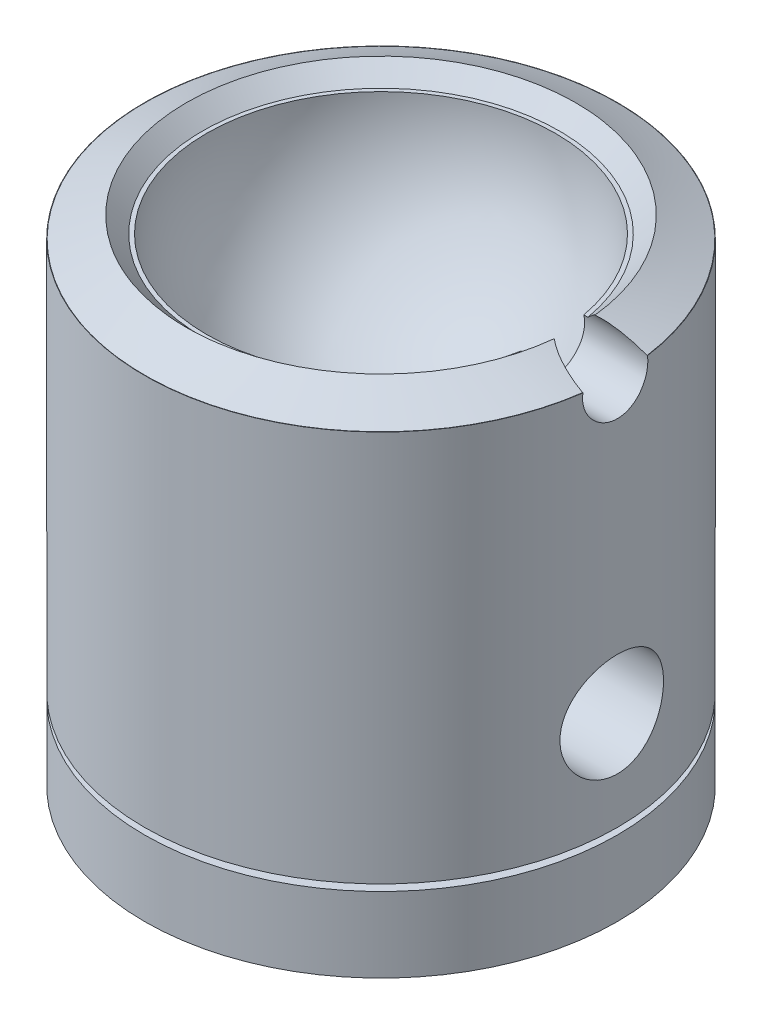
ISO-10303-21;
HEADER;
FILE_DESCRIPTION(('STEP AP214'),'2;1');
FILE_NAME('part.step','',(''),(''),'','','');
FILE_SCHEMA(('AUTOMOTIVE_DESIGN { 1 0 10303 214 1 1 1 1 }'));
ENDSEC;
DATA;
#1=APPLICATION_CONTEXT('core data for automotive mechanical design processes');
#2=APPLICATION_PROTOCOL_DEFINITION('international standard','automotive_design',2000,#1);
#3=PRODUCT_CONTEXT('',#1,'mechanical');
#4=PRODUCT('Part','Part','',(#3));
#5=PRODUCT_RELATED_PRODUCT_CATEGORY('part','',(#4));
#6=PRODUCT_DEFINITION_FORMATION('','',#4);
#7=PRODUCT_DEFINITION_CONTEXT('part definition',#1,'design');
#8=PRODUCT_DEFINITION('design','',#6,#7);
#9=PRODUCT_DEFINITION_SHAPE('','',#8);
#10=(LENGTH_UNIT() NAMED_UNIT(*) SI_UNIT(.MILLI.,.METRE.));
#11=(NAMED_UNIT(*) PLANE_ANGLE_UNIT() SI_UNIT($,.RADIAN.));
#12=(NAMED_UNIT(*) SI_UNIT($,.STERADIAN.) SOLID_ANGLE_UNIT());
#13=UNCERTAINTY_MEASURE_WITH_UNIT(LENGTH_MEASURE(1.E-05),#10,'distance_accuracy_value','');
#14=(GEOMETRIC_REPRESENTATION_CONTEXT(3) GLOBAL_UNCERTAINTY_ASSIGNED_CONTEXT((#13)) GLOBAL_UNIT_ASSIGNED_CONTEXT((#10,
#11,#12)) REPRESENTATION_CONTEXT('',''));
#15=CARTESIAN_POINT('',(0.,0.,0.));
#16=DIRECTION('',(0.,0.,1.));
#17=DIRECTION('',(1.,0.,0.));
#18=AXIS2_PLACEMENT_3D('',#15,#16,#17);
#19=CARTESIAN_POINT('',(0.,29.,0.));
#20=DIRECTION('',(0.,-1.,0.));
#21=DIRECTION('',(0.,0.,-1.));
#22=AXIS2_PLACEMENT_3D('',#19,#20,#21);
#23=CYLINDRICAL_SURFACE('',#22,14.5);
#24=CARTESIAN_POINT('',(-14.100984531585,20.063256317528,3.3782));
#25=CARTESIAN_POINT('',(-14.1009882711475,19.8762854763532,3.37819402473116));
#26=CARTESIAN_POINT('',(-14.1047437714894,19.6892454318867,3.36262495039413));
#27=CARTESIAN_POINT('',(-14.119327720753,19.320507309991,3.3008417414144));
#28=CARTESIAN_POINT('',(-14.1301608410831,19.1388128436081,3.25460736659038));
#29=CARTESIAN_POINT('',(-14.1576080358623,18.7861528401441,3.1330472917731));
#30=CARTESIAN_POINT('',(-14.1742152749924,18.6151748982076,3.05775597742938));
#31=CARTESIAN_POINT('',(-14.2113311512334,18.2882667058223,2.88032065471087));
#32=CARTESIAN_POINT('',(-14.2318398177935,18.1323365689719,2.77817644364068));
#33=CARTESIAN_POINT('',(-14.274886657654,17.8369651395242,2.54784912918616));
#34=CARTESIAN_POINT('',(-14.2974536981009,17.6978540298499,2.41924791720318));
#35=CARTESIAN_POINT('',(-14.3418228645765,17.4429687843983,2.14055887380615));
#36=CARTESIAN_POINT('',(-14.3636249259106,17.3271966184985,1.99046923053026));
#37=CARTESIAN_POINT('',(-14.4043242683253,17.1209496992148,1.67082860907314));
#38=CARTESIAN_POINT('',(-14.4231835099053,17.0307955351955,1.50106551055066));
#39=CARTESIAN_POINT('',(-14.4555447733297,16.8804224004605,1.1482839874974));
#40=CARTESIAN_POINT('',(-14.4690474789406,16.8201996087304,0.965267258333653));
#41=CARTESIAN_POINT('',(-14.4889702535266,16.7324456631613,0.594611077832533));
#42=CARTESIAN_POINT('',(-14.4955114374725,16.704354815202,0.407110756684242));
#43=CARTESIAN_POINT('',(-14.5011948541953,16.6799091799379,0.0299524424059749));
#44=CARTESIAN_POINT('',(-14.5003380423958,16.6835502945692,-0.15970526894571));
#45=CARTESIAN_POINT('',(-14.4914135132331,16.7220546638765,-0.53192604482));
#46=CARTESIAN_POINT('',(-14.4834852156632,16.7563142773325,-0.71455539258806));
#47=CARTESIAN_POINT('',(-14.4614688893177,16.8541175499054,-1.07139865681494));
#48=CARTESIAN_POINT('',(-14.4473805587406,16.9176626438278,-1.24561216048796));
#49=CARTESIAN_POINT('',(-14.4144077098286,17.0727467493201,-1.5823164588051));
#50=CARTESIAN_POINT('',(-14.395485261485,17.1645083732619,-1.74470085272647));
#51=CARTESIAN_POINT('',(-14.3549094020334,17.3732535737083,-2.05198279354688));
#52=CARTESIAN_POINT('',(-14.333255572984,17.4902410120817,-2.19687765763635));
#53=CARTESIAN_POINT('',(-14.2889865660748,17.7493816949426,-2.46866268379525));
#54=CARTESIAN_POINT('',(-14.2663607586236,17.8920630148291,-2.59504809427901));
#55=CARTESIAN_POINT('',(-14.2231710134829,18.1968313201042,-2.82220023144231));
#56=CARTESIAN_POINT('',(-14.2026071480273,18.358918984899,-2.92296606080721));
#57=CARTESIAN_POINT('',(-14.1658367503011,18.6987909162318,-3.09628565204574));
#58=CARTESIAN_POINT('',(-14.1496467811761,18.87663155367,-3.16873262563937));
#59=CARTESIAN_POINT('',(-14.1236782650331,19.2424324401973,-3.2825533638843));
#60=CARTESIAN_POINT('',(-14.1138985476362,19.4303908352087,-3.32393280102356));
#61=CARTESIAN_POINT('',(-14.1020996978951,19.8064492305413,-3.37363713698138));
#62=CARTESIAN_POINT('',(-14.0999068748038,19.9944460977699,-3.38270198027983));
#63=CARTESIAN_POINT('',(-14.1030596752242,20.3692651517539,-3.36953304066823));
#64=CARTESIAN_POINT('',(-14.1084047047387,20.5560874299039,-3.34730172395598));
#65=CARTESIAN_POINT('',(-14.1258658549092,20.920603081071,-3.27281663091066));
#66=CARTESIAN_POINT('',(-14.137887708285,21.0983867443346,-3.22098054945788));
#67=CARTESIAN_POINT('',(-14.1672609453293,21.4427441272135,-3.08921435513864));
#68=CARTESIAN_POINT('',(-14.1846128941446,21.6093166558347,-3.00928126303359));
#69=CARTESIAN_POINT('',(-14.2230657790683,21.9296961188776,-2.82199594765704));
#70=CARTESIAN_POINT('',(-14.2442263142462,22.0832327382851,-2.71419380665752));
#71=CARTESIAN_POINT('',(-14.2877598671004,22.3703084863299,-2.47481038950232));
#72=CARTESIAN_POINT('',(-14.3101330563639,22.503844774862,-2.34322574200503));
#73=CARTESIAN_POINT('',(-14.3541506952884,22.7500562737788,-2.05664296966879));
#74=CARTESIAN_POINT('',(-14.3757692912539,22.8622237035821,-1.90120392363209));
#75=CARTESIAN_POINT('',(-14.415341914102,23.05885754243,-1.57326230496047));
#76=CARTESIAN_POINT('',(-14.4332961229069,23.1433253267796,-1.40076058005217));
#77=CARTESIAN_POINT('',(-14.4634092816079,23.281482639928,-1.0447288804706));
#78=CARTESIAN_POINT('',(-14.4756073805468,23.3353806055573,-0.861283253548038));
#79=CARTESIAN_POINT('',(-14.4930041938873,23.4115094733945,-0.487621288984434));
#80=CARTESIAN_POINT('',(-14.4982040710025,23.4337456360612,-0.297406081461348));
#81=CARTESIAN_POINT('',(-14.5009783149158,23.4456567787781,0.0795978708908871));
#82=CARTESIAN_POINT('',(-14.4987292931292,23.4360858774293,0.266361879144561));
#83=CARTESIAN_POINT('',(-14.4872426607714,23.3863591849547,0.635541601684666));
#84=CARTESIAN_POINT('',(-14.4780052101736,23.3462040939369,0.817957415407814));
#85=CARTESIAN_POINT('',(-14.4535991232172,23.2368300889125,1.17258798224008));
#86=CARTESIAN_POINT('',(-14.4384550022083,23.167731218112,1.344841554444));
#87=CARTESIAN_POINT('',(-14.4038424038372,23.0025435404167,1.67540352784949));
#88=CARTESIAN_POINT('',(-14.3843734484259,22.9064517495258,1.83371038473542));
#89=CARTESIAN_POINT('',(-14.3427082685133,22.6876169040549,2.13551969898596));
#90=CARTESIAN_POINT('',(-14.3204629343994,22.564351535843,2.27863668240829));
#91=CARTESIAN_POINT('',(-14.2759965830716,22.2957050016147,2.54241124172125));
#92=CARTESIAN_POINT('',(-14.25377557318,22.1503184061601,2.66306328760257));
#93=CARTESIAN_POINT('',(-14.2114830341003,21.8388219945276,2.88031622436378));
#94=CARTESIAN_POINT('',(-14.1914505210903,21.6724238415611,2.97651180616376));
#95=CARTESIAN_POINT('',(-14.1563075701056,21.3253829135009,3.13941912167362));
#96=CARTESIAN_POINT('',(-14.1411932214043,21.1447515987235,3.20615429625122));
#97=CARTESIAN_POINT('',(-14.1202049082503,20.813995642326,3.29719221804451));
#98=CARTESIAN_POINT('',(-14.1130478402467,20.6655785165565,3.32750848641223));
#99=CARTESIAN_POINT('',(-14.1034362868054,20.3658746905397,3.36801416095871));
#100=CARTESIAN_POINT('',(-14.1009815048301,20.214588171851,3.37820483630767));
#101=CARTESIAN_POINT('',(-14.100984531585,20.063256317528,3.3782));
#102=B_SPLINE_CURVE_WITH_KNOTS('',3,(#24,#25,#26,#27,#28,#29,#30,#31,#32,#33,#34,#35,#36,#37,
#38,#39,#40,#41,#42,#43,#44,#45,#46,#47,#48,#49,#50,#51,#52,#53,#54,#55,#56,#57,#58,#59,#60,#61,
#62,#63,#64,#65,#66,#67,#68,#69,#70,#71,#72,#73,#74,#75,#76,#77,#78,#79,#80,#81,#82,#83,#84,#85,
#86,#87,#88,#89,#90,#91,#92,#93,#94,#95,#96,#97,#98,#99,#100,#101),.UNSPECIFIED.,.T.,.F.,(4,2,2,
2,2,2,2,2,2,2,2,2,2,2,2,2,2,2,2,2,2,2,2,2,2,2,2,2,2,2,2,2,2,2,2,2,2,2,4),(0.,0.560357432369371,
1.1210850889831,1.68115121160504,2.24122156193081,2.81093651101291,3.38069952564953,
3.95730678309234,4.53384041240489,5.10017091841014,5.66642828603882,6.22176234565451,
6.77712361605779,7.33698394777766,7.89693005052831,8.47007149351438,9.04323300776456,
9.6185354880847,10.1937329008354,10.7556716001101,11.3175660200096,11.8717218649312,
12.425936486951,12.9897275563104,13.5535986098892,14.1295407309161,14.7054542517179,
15.2773922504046,15.8492352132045,16.4076178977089,16.9659878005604,17.5220644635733,
18.0782026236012,18.6461430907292,19.214223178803,19.7911806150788,20.3676781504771,
20.8212530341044,21.2747993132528),.UNSPECIFIED.);
#103=CARTESIAN_POINT('',(-14.100984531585,20.063256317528,3.3782));
#104=VERTEX_POINT('',#103);
#105=EDGE_CURVE('E12',#104,#104,#102,.T.);
#106=ORIENTED_EDGE('',*,*,#105,.T.);
#107=EDGE_LOOP('',(#106));
#108=FACE_BOUND('',#107,.T.);
#109=CARTESIAN_POINT('',(14.1481226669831,11.0195593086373,-3.175));
#110=CARTESIAN_POINT('',(14.1481262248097,10.8435273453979,-3.1749939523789));
#111=CARTESIAN_POINT('',(14.1514437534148,10.667422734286,-3.1603105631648));
#112=CARTESIAN_POINT('',(14.1643309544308,10.3202219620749,-3.10202946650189));
#113=CARTESIAN_POINT('',(14.1739051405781,10.1491295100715,-3.05841088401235));
#114=CARTESIAN_POINT('',(14.1981705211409,9.81702568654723,-2.94369897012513));
#115=CARTESIAN_POINT('',(14.2128560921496,9.65600346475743,-2.87263582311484));
#116=CARTESIAN_POINT('',(14.245682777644,9.34816299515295,-2.70513841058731));
#117=CARTESIAN_POINT('',(14.2638238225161,9.20134446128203,-2.60870465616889));
#118=CARTESIAN_POINT('',(14.3018605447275,8.92359115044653,-2.39146318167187));
#119=CARTESIAN_POINT('',(14.3217787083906,8.79293184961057,-2.27030712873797));
#120=CARTESIAN_POINT('',(14.3609285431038,8.55361867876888,-2.00781216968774));
#121=CARTESIAN_POINT('',(14.3801601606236,8.44496652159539,-1.86647169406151));
#122=CARTESIAN_POINT('',(14.4160149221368,8.25166194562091,-1.56577281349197));
#123=CARTESIAN_POINT('',(14.4326084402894,8.16727452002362,-1.40624022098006));
#124=CARTESIAN_POINT('',(14.4610633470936,8.02660934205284,-1.07483427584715));
#125=CARTESIAN_POINT('',(14.4729252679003,7.97032842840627,-0.902962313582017));
#126=CARTESIAN_POINT('',(14.4904215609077,7.88834040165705,-0.554620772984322));
#127=CARTESIAN_POINT('',(14.4961508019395,7.86216705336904,-0.378265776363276));
#128=CARTESIAN_POINT('',(14.5010649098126,7.83967935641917,-0.0235811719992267));
#129=CARTESIAN_POINT('',(14.5002505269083,7.84336158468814,0.154748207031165));
#130=CARTESIAN_POINT('',(14.4922416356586,7.88013336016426,0.505105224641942));
#131=CARTESIAN_POINT('',(14.4851561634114,7.91272035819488,0.677188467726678));
#132=CARTESIAN_POINT('',(14.46552548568,8.00557577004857,1.0133830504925));
#133=CARTESIAN_POINT('',(14.4529800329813,8.06584543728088,1.17749402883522));
#134=CARTESIAN_POINT('',(14.4236637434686,8.2127996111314,1.49448013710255));
#135=CARTESIAN_POINT('',(14.4068626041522,8.29967452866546,1.6472640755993));
#136=CARTESIAN_POINT('',(14.3708769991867,8.49723113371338,1.9362681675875));
#137=CARTESIAN_POINT('',(14.351692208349,8.60791607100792,2.07248605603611));
#138=CARTESIAN_POINT('',(14.3125765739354,8.85268644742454,2.32748024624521));
#139=CARTESIAN_POINT('',(14.2926385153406,8.98721171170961,2.44583362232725));
#140=CARTESIAN_POINT('',(14.2546381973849,9.27440671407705,2.65837956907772));
#141=CARTESIAN_POINT('',(14.2365759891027,9.42707694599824,2.75257148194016));
#142=CARTESIAN_POINT('',(14.2043533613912,9.74691299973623,2.91430931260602));
#143=CARTESIAN_POINT('',(14.1902047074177,9.9141205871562,2.98177514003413));
#144=CARTESIAN_POINT('',(14.1675740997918,10.2578829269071,3.08752310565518));
#145=CARTESIAN_POINT('',(14.1590912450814,10.4344361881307,3.1258098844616));
#146=CARTESIAN_POINT('',(14.1489365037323,10.7880133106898,3.17145658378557));
#147=CARTESIAN_POINT('',(14.1471290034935,10.9649538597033,3.17943238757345));
#148=CARTESIAN_POINT('',(14.1501637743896,11.3176364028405,3.16589830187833));
#149=CARTESIAN_POINT('',(14.1550055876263,11.4933784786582,3.14439044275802));
#150=CARTESIAN_POINT('',(14.1706653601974,11.8365298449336,3.073033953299));
#151=CARTESIAN_POINT('',(14.1814117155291,12.0040132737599,3.02352468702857));
#152=CARTESIAN_POINT('',(14.2076051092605,12.3283075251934,2.8979382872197));
#153=CARTESIAN_POINT('',(14.2230525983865,12.4851173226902,2.8218586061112));
#154=CARTESIAN_POINT('',(14.2572055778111,12.7862778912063,2.64393458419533));
#155=CARTESIAN_POINT('',(14.2759576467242,12.9303991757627,2.54171093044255));
#156=CARTESIAN_POINT('',(14.3144841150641,13.1996680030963,2.31489692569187));
#157=CARTESIAN_POINT('',(14.3342586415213,13.3248131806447,2.19030379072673));
#158=CARTESIAN_POINT('',(14.3730490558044,13.5549686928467,1.91950031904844));
#159=CARTESIAN_POINT('',(14.3920438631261,13.659559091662,1.77292954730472));
#160=CARTESIAN_POINT('',(14.4267463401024,13.8426327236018,1.46394104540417));
#161=CARTESIAN_POINT('',(14.4424541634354,13.9211171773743,1.30152405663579));
#162=CARTESIAN_POINT('',(14.4687239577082,14.0491666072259,0.966466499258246));
#163=CARTESIAN_POINT('',(14.4793184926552,14.0989149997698,0.793898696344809));
#164=CARTESIAN_POINT('',(14.4943088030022,14.1686527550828,0.44259689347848));
#165=CARTESIAN_POINT('',(14.4987054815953,14.1886464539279,0.263863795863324));
#166=CARTESIAN_POINT('',(14.5007778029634,14.1981119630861,-0.0907087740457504));
#167=CARTESIAN_POINT('',(14.4985915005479,14.1882107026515,-0.266530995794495));
#168=CARTESIAN_POINT('',(14.4880393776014,14.1395699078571,-0.613940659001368));
#169=CARTESIAN_POINT('',(14.4796736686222,14.1008308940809,-0.78552817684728));
#170=CARTESIAN_POINT('',(14.4577130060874,13.995914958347,-1.11911156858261));
#171=CARTESIAN_POINT('',(14.444135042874,13.9298271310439,-1.28113665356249));
#172=CARTESIAN_POINT('',(14.4131996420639,13.7721763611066,-1.5918817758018));
#173=CARTESIAN_POINT('',(14.3958418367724,13.6806109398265,-1.74060051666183));
#174=CARTESIAN_POINT('',(14.3588280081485,13.4725609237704,-2.02356875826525));
#175=CARTESIAN_POINT('',(14.339134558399,13.3556355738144,-2.15748933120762));
#176=CARTESIAN_POINT('',(14.299870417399,13.1010735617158,-2.40402291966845));
#177=CARTESIAN_POINT('',(14.2802997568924,12.963431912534,-2.51663078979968));
#178=CARTESIAN_POINT('',(14.2432045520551,12.6691253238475,-2.718797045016));
#179=CARTESIAN_POINT('',(14.2257109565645,12.5122300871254,-2.80802617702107));
#180=CARTESIAN_POINT('',(14.195139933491,12.1853214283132,-2.95870899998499));
#181=CARTESIAN_POINT('',(14.1820587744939,12.0153192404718,-3.02018617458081));
#182=CARTESIAN_POINT('',(14.1642094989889,11.7075492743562,-3.10265753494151));
#183=CARTESIAN_POINT('',(14.1582170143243,11.5714496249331,-3.129733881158));
#184=CARTESIAN_POINT('',(14.1501722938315,11.2967680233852,-3.16590705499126));
#185=CARTESIAN_POINT('',(14.14811986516,11.1581861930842,-3.17500476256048));
#186=CARTESIAN_POINT('',(14.1481226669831,11.0195593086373,-3.175));
#187=B_SPLINE_CURVE_WITH_KNOTS('',3,(#109,#110,#111,#112,#113,#114,#115,#116,#117,#118,#119,
#120,#121,#122,#123,#124,#125,#126,#127,#128,#129,#130,#131,#132,#133,#134,#135,#136,#137,#138,
#139,#140,#141,#142,#143,#144,#145,#146,#147,#148,#149,#150,#151,#152,#153,#154,#155,#156,#157,
#158,#159,#160,#161,#162,#163,#164,#165,#166,#167,#168,#169,#170,#171,#172,#173,#174,#175,#176,
#177,#178,#179,#180,#181,#182,#183,#184,#185,#186),.UNSPECIFIED.,.T.,.F.,(4,2,2,2,2,2,2,2,2,2,2,
2,2,2,2,2,2,2,2,2,2,2,2,2,2,2,2,2,2,2,2,2,2,2,2,2,2,2,4),(0.,0.52758782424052,1.05555668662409,
1.58294651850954,2.11032572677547,2.6457242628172,3.18116445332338,3.72224748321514,
4.26326964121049,4.79579588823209,5.32826107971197,5.851646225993,6.37505507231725,
6.90230108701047,7.42961911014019,7.96793289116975,8.50626132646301,9.04619098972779,
9.58603476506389,10.1148490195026,10.6436268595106,11.1661294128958,11.6886820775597,
12.2192950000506,12.7499740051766,13.2905692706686,13.8311392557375,14.368219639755,
14.905221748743,15.431041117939,15.9568509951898,16.4809612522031,17.0051225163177,
17.5392513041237,18.0735088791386,18.6149289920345,19.1558900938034,19.5713909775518,
19.9868715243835),.UNSPECIFIED.);
#188=CARTESIAN_POINT('',(14.1481226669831,11.0195593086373,-3.175));
#189=VERTEX_POINT('',#188);
#190=EDGE_CURVE('E59',#189,#189,#187,.T.);
#191=ORIENTED_EDGE('',*,*,#190,.T.);
#192=EDGE_LOOP('',(#191));
#193=FACE_BOUND('',#192,.T.);
#194=CARTESIAN_POINT('',(0.,29.,0.));
#195=DIRECTION('',(0.,1.,0.));
#196=DIRECTION('',(0.,0.,1.));
#197=AXIS2_PLACEMENT_3D('',#194,#195,#196);
#198=CIRCLE('',#197,14.5);
#199=CARTESIAN_POINT('',(14.3643343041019,29.,-1.97886331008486));
#200=VERTEX_POINT('',#199);
#201=CARTESIAN_POINT('',(14.3643343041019,29.,1.97886331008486));
#202=VERTEX_POINT('',#201);
#203=EDGE_CURVE('E237',#200,#202,#198,.T.);
#204=ORIENTED_EDGE('',*,*,#203,.F.);
#205=CARTESIAN_POINT('',(14.3643343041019,29.,-1.97886331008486));
#206=CARTESIAN_POINT('',(14.3632171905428,28.9447557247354,-1.98695918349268));
#207=CARTESIAN_POINT('',(14.3624162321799,28.8891921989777,-1.99273745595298));
#208=CARTESIAN_POINT('',(14.3614587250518,28.777774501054,-1.99963119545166));
#209=CARTESIAN_POINT('',(14.3613021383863,28.7219203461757,-2.00074693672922));
#210=CARTESIAN_POINT('',(14.3618162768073,28.5546496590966,-1.99706473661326));
#211=CARTESIAN_POINT('',(14.363466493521,28.4433086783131,-1.98526884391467));
#212=CARTESIAN_POINT('',(14.3692015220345,28.2242211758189,-1.94331724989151));
#213=CARTESIAN_POINT('',(14.3732873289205,28.1164761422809,-1.91315404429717));
#214=CARTESIAN_POINT('',(14.3834272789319,27.9075886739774,-1.83536099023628));
#215=CARTESIAN_POINT('',(14.389481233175,27.8064456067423,-1.78773281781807));
#216=CARTESIAN_POINT('',(14.4029074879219,27.6131422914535,-1.67613087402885));
#217=CARTESIAN_POINT('',(14.4102853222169,27.5210223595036,-1.61208798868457));
#218=CARTESIAN_POINT('',(14.4255182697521,27.3487680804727,-1.46954002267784));
#219=CARTESIAN_POINT('',(14.4333734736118,27.2686360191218,-1.39103219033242));
#220=CARTESIAN_POINT('',(14.448746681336,27.122029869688,-1.2210810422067));
#221=CARTESIAN_POINT('',(14.456261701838,27.0556631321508,-1.12954480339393));
#222=CARTESIAN_POINT('',(14.4700457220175,26.9392439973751,-0.936547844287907));
#223=CARTESIAN_POINT('',(14.4763148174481,26.8891903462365,-0.835087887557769));
#224=CARTESIAN_POINT('',(14.4868893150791,26.8069415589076,-0.625325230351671));
#225=CARTESIAN_POINT('',(14.4911989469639,26.7747079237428,-0.517037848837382));
#226=CARTESIAN_POINT('',(14.4973872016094,26.7289000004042,-0.296517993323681));
#227=CARTESIAN_POINT('',(14.4992659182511,26.7153249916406,-0.184285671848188));
#228=CARTESIAN_POINT('',(14.500374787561,26.7072807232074,0.0399256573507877));
#229=CARTESIAN_POINT('',(14.4996270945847,26.7126516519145,0.151898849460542));
#230=CARTESIAN_POINT('',(14.4956161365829,26.7419820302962,0.373334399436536));
#231=CARTESIAN_POINT('',(14.492352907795,26.7659412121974,0.482796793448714));
#232=CARTESIAN_POINT('',(14.4836814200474,26.8316818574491,0.695946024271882));
#233=CARTESIAN_POINT('',(14.4782765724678,26.8734349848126,0.799641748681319));
#234=CARTESIAN_POINT('',(14.4659181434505,26.9735539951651,0.998577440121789));
#235=CARTESIAN_POINT('',(14.4589644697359,27.0319208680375,1.09381690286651));
#236=CARTESIAN_POINT('',(14.4442151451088,27.1641387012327,1.27392650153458));
#237=CARTESIAN_POINT('',(14.4364134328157,27.2381052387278,1.35871130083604));
#238=CARTESIAN_POINT('',(14.42088156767,27.3991847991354,1.51470570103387));
#239=CARTESIAN_POINT('',(14.4131514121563,27.4862973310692,1.58591580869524));
#240=CARTESIAN_POINT('',(14.3985910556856,27.6717335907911,1.71309862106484));
#241=CARTESIAN_POINT('',(14.3917655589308,27.7701113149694,1.76899317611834));
#242=CARTESIAN_POINT('',(14.3798388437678,27.9750096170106,1.86346881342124));
#243=CARTESIAN_POINT('',(14.3747382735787,28.0815332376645,1.90204338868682));
#244=CARTESIAN_POINT('',(14.366873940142,28.2991050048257,1.9605628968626));
#245=CARTESIAN_POINT('',(14.3640993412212,28.4101296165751,1.98059426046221));
#246=CARTESIAN_POINT('',(14.3611747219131,28.6338781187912,2.00169527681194));
#247=CARTESIAN_POINT('',(14.3610196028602,28.7465982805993,2.00280176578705));
#248=CARTESIAN_POINT('',(14.3624181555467,28.8821255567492,1.99272222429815));
#249=CARTESIAN_POINT('',(14.3627215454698,28.905786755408,1.99053617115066));
#250=CARTESIAN_POINT('',(14.363442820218,28.9529833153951,1.98532610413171));
#251=CARTESIAN_POINT('',(14.3638605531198,28.976518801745,1.98230320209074));
#252=CARTESIAN_POINT('',(14.364334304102,29.,1.97886331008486));
#253=B_SPLINE_CURVE_WITH_KNOTS('',3,(#205,#206,#207,#208,#209,#210,#211,#212,#213,#214,#215,
#216,#217,#218,#219,#220,#221,#222,#223,#224,#225,#226,#227,#228,#229,#230,#231,#232,#233,#234,
#235,#236,#237,#238,#239,#240,#241,#242,#243,#244,#245,#246,#247,#248,#249,#250,#251,#252),
.UNSPECIFIED.,.F.,.F.,(4,2,2,2,2,2,2,2,2,2,2,2,2,2,2,2,2,2,2,2,2,2,2,4),(0.,0.167433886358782,
0.334857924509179,0.669058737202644,1.00339618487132,1.33770155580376,1.67343832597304,
2.00923902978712,2.34756746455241,2.68586988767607,3.02343854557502,3.3609941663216,
3.69570929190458,4.03041959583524,4.36459887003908,4.69879805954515,5.03556623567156,
5.3723218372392,5.71076506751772,6.0493353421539,6.38631946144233,6.72264758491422,
6.79393193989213,6.8651220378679),.UNSPECIFIED.);
#254=EDGE_CURVE('E73',#200,#202,#253,.T.);
#255=ORIENTED_EDGE('',*,*,#254,.T.);
#256=EDGE_LOOP('',(#204,#255));
#257=FACE_BOUND('',#256,.T.);
#258=CARTESIAN_POINT('',(0.,5.,0.));
#259=DIRECTION('',(0.,-1.,0.));
#260=DIRECTION('',(0.,0.,-1.));
#261=AXIS2_PLACEMENT_3D('',#258,#259,#260);
#262=CIRCLE('',#261,14.5);
#263=CARTESIAN_POINT('',(0.,5.,-14.5));
#264=VERTEX_POINT('',#263);
#265=EDGE_CURVE('E129',#264,#264,#262,.T.);
#266=ORIENTED_EDGE('',*,*,#265,.F.);
#267=EDGE_LOOP('',(#266));
#268=FACE_BOUND('',#267,.T.);
#269=ADVANCED_FACE('F46',(#108,#193,#257,#268),#23,.T.);
#270=CARTESIAN_POINT('',(0.,29.,0.));
#271=DIRECTION('',(0.,1.,0.));
#272=DIRECTION('',(0.,0.,1.));
#273=AXIS2_PLACEMENT_3D('',#270,#271,#272);
#274=PLANE('',#273);
#275=DIRECTION('',(1.,0.,0.));
#276=VECTOR('',#275,1.);
#277=CARTESIAN_POINT('',(8.96,29.,1.97886331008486));
#278=LINE('',#277,#276);
#279=CARTESIAN_POINT('',(14.3421262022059,29.,1.97886331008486));
#280=VERTEX_POINT('',#279);
#281=EDGE_CURVE('E284',#280,#202,#278,.T.);
#282=ORIENTED_EDGE('',*,*,#281,.F.);
#283=CARTESIAN_POINT('',(0.,29.,0.));
#284=DIRECTION('',(0.,1.,0.));
#285=DIRECTION('',(0.,0.,1.));
#286=AXIS2_PLACEMENT_3D('',#283,#284,#285);
#287=CIRCLE('',#286,14.478);
#288=CARTESIAN_POINT('',(14.3421262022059,29.,-1.97886331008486));
#289=VERTEX_POINT('',#288);
#290=EDGE_CURVE('E272',#289,#280,#287,.T.);
#291=ORIENTED_EDGE('',*,*,#290,.F.);
#292=DIRECTION('',(1.,0.,0.));
#293=VECTOR('',#292,1.);
#294=CARTESIAN_POINT('',(8.96,29.,-1.97886331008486));
#295=LINE('',#294,#293);
#296=EDGE_CURVE('E193',#200,#289,#295,.F.);
#297=ORIENTED_EDGE('',*,*,#296,.F.);
#298=ORIENTED_EDGE('',*,*,#203,.T.);
#299=EDGE_LOOP('',(#282,#291,#297,#298));
#300=FACE_BOUND('',#299,.T.);
#301=ADVANCED_FACE('F202',(#300),#274,.T.);
#302=CARTESIAN_POINT('',(-2.48694085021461,30.27,11.6760853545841));
#303=CARTESIAN_POINT('',(-5.53208529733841,29.,13.3794064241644));
#304=CARTESIAN_POINT('',(-25.8391115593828,30.27,6.70220365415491));
#305=CARTESIAN_POINT('',(-32.2908981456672,29.,2.31523582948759));
#306=CARTESIAN_POINT('',(-20.8652298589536,30.27,-16.6499670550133));
#307=CARTESIAN_POINT('',(-21.2267275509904,29.,-24.4435770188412));
#308=CARTESIAN_POINT('',(2.4869408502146,30.27,-11.6760853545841));
#309=CARTESIAN_POINT('',(5.53208529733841,29.,-13.3794064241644));
#310=CARTESIAN_POINT('',(25.8391115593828,30.27,-6.70220365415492));
#311=CARTESIAN_POINT('',(32.2908981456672,29.,-2.31523582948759));
#312=CARTESIAN_POINT('',(20.8652298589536,30.27,16.6499670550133));
#313=CARTESIAN_POINT('',(21.2267275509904,29.,24.4435770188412));
#314=CARTESIAN_POINT('',(-2.48694085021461,30.27,11.6760853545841));
#315=CARTESIAN_POINT('',(-5.53208529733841,29.,13.3794064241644));
#316=(BOUNDED_SURFACE() B_SPLINE_SURFACE(3,1,((#302,#303),(#304,#305),(#306,#307),(#308,#309),
(#310,#311),(#312,#313),(#314,#315)),.UNSPECIFIED.,.T.,.F.,.F.) B_SPLINE_SURFACE_WITH_KNOTS((4,
3,4),(2,2),(0.,0.5,1.),(0.,1.),
.UNSPECIFIED.) GEOMETRIC_REPRESENTATION_ITEM() RATIONAL_B_SPLINE_SURFACE(((1.,1.),
(0.333333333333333,0.333333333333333),(0.333333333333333,0.333333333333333),(1.,1.),
(0.333333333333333,0.333333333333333),(0.333333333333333,0.333333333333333),(1.,1.))) REPRESENTATION_ITEM('') SURFACE());
#317=CARTESIAN_POINT('',(11.8722131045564,30.27,1.25155902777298));
#318=CARTESIAN_POINT('',(11.9113434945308,30.2468430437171,1.28041299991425));
#319=CARTESIAN_POINT('',(11.9512722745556,30.2234453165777,1.30794749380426));
#320=CARTESIAN_POINT('',(12.0324779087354,30.1763166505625,1.36057618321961));
#321=CARTESIAN_POINT('',(12.0737539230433,30.1525859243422,1.38567186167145));
#322=CARTESIAN_POINT('',(12.1990808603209,30.0812003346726,1.45752087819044));
#323=CARTESIAN_POINT('',(12.2848412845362,30.0332274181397,1.50098740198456));
#324=CARTESIAN_POINT('',(12.4588984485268,29.9375062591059,1.58020684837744));
#325=CARTESIAN_POINT('',(12.5471703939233,29.8897591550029,1.61601691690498));
#326=CARTESIAN_POINT('',(12.7261183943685,29.7944286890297,1.68147507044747));
#327=CARTESIAN_POINT('',(12.8167959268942,29.7468454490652,1.71111926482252));
#328=CARTESIAN_POINT('',(12.9658577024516,29.6696944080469,1.75503755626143));
#329=CARTESIAN_POINT('',(13.023713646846,29.6400062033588,1.77092836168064));
#330=CARTESIAN_POINT('',(13.1399950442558,29.5808192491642,1.80076979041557));
#331=CARTESIAN_POINT('',(13.1984203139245,29.5513204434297,1.81472101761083));
#332=CARTESIAN_POINT('',(13.3746498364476,29.4630171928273,1.85394831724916));
#333=CARTESIAN_POINT('',(13.4932063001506,29.4045100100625,1.87653991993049));
#334=CARTESIAN_POINT('',(13.7330554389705,29.287727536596,1.91574332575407));
#335=CARTESIAN_POINT('',(13.8543638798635,29.2294620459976,1.93228589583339));
#336=CARTESIAN_POINT('',(14.0977105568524,29.1139850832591,1.95966035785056));
#337=CARTESIAN_POINT('',(14.2197458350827,29.0567711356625,1.97050796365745));
#338=CARTESIAN_POINT('',(14.3421262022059,29.,1.97886331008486));
#339=B_SPLINE_CURVE_WITH_KNOTS('',3,(#317,#318,#319,#320,#321,#322,#323,#324,#325,#326,#327,
#328,#329,#330,#331,#332,#333,#334,#335,#336,#337,#338),.UNSPECIFIED.,.F.,.F.,(4,2,2,2,2,2,2,2,
2,2,4),(0.,0.16149532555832,0.322891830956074,0.644825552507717,0.964265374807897,
1.28390615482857,1.48470346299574,1.68543811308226,2.08760872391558,2.49424800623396,
2.89975928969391),.UNSPECIFIED.);
#340=CARTESIAN_POINT('',(11.8722131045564,30.27,1.25155902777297));
#341=VERTEX_POINT('',#340);
#342=EDGE_CURVE('E187',#341,#280,#339,.T.);
#343=CARTESIAN_POINT('',(0.,30.27,0.));
#344=DIRECTION('',(0.,1.,0.));
#345=DIRECTION('',(0.,0.,1.));
#346=AXIS2_PLACEMENT_3D('',#343,#344,#345);
#347=CIRCLE('',#346,11.938);
#348=CARTESIAN_POINT('',(11.8722131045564,30.27,-1.25155902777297));
#349=VERTEX_POINT('',#348);
#350=EDGE_CURVE('E278',#349,#341,#347,.T.);
#351=CARTESIAN_POINT('',(14.3421262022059,29.,-1.97886331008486));
#352=CARTESIAN_POINT('',(14.2667279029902,29.0349748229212,-1.97373473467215));
#353=CARTESIAN_POINT('',(14.1914742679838,29.0701130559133,-1.96764175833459));
#354=CARTESIAN_POINT('',(14.0413088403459,29.1407306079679,-1.95339972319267));
#355=CARTESIAN_POINT('',(13.9663971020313,29.1762099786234,-1.94525034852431));
#356=CARTESIAN_POINT('',(13.7415587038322,29.283513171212,-1.91743918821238));
#357=CARTESIAN_POINT('',(13.5922665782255,29.3558606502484,-1.89446188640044));
#358=CARTESIAN_POINT('',(13.3066246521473,29.4967715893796,-1.84018601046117));
#359=CARTESIAN_POINT('',(13.1700998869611,29.5652458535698,-1.80958174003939));
#360=CARTESIAN_POINT('',(12.9006627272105,29.7029918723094,-1.73781410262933));
#361=CARTESIAN_POINT('',(12.7677413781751,29.7722608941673,-1.69668020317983));
#362=CARTESIAN_POINT('',(12.5699768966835,29.877606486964,-1.62436978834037));
#363=CARTESIAN_POINT('',(12.5032930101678,29.9135374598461,-1.59799570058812));
#364=CARTESIAN_POINT('',(12.3716306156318,29.9853497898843,-1.54129052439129));
#365=CARTESIAN_POINT('',(12.3066513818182,30.0212311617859,-1.51096115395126));
#366=CARTESIAN_POINT('',(12.1784240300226,30.0929685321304,-1.44560580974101));
#367=CARTESIAN_POINT('',(12.1151889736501,30.1288230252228,-1.4105521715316));
#368=CARTESIAN_POINT('',(11.9914509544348,30.1999555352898,-1.33517308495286));
#369=CARTESIAN_POINT('',(11.9309523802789,30.2352325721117,-1.294839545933));
#370=CARTESIAN_POINT('',(11.8722131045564,30.27,-1.25155902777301));
#371=B_SPLINE_CURVE_WITH_KNOTS('',3,(#351,#352,#353,#354,#355,#356,#357,#358,#359,#360,#361,
#362,#363,#364,#365,#366,#367,#368,#369,#370),.UNSPECIFIED.,.F.,.F.,(4,2,2,2,2,2,2,2,2,4),(0.,
0.249806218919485,0.499650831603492,1.00178001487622,1.46879384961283,1.93451475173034,
2.17504618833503,2.41547349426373,2.65737539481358,2.89965241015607),.UNSPECIFIED.);
#372=EDGE_CURVE('E180',#289,#349,#371,.T.);
#373=ORIENTED_EDGE('',*,*,#342,.F.);
#374=ORIENTED_EDGE('',*,*,#350,.F.);
#375=ORIENTED_EDGE('',*,*,#372,.F.);
#376=ORIENTED_EDGE('',*,*,#290,.T.);
#377=EDGE_LOOP('',(#373,#374,#375,#376));
#378=FACE_BOUND('',#377,.T.);
#379=ADVANCED_FACE('F195',(#378),#316,.T.);
#380=CARTESIAN_POINT('',(0.,29.270002,0.));
#381=DIRECTION('',(0.,1.,0.));
#382=DIRECTION('',(0.,0.,1.));
#383=AXIS2_PLACEMENT_3D('',#380,#381,#382);
#384=PLANE('',#383);
#385=DIRECTION('',(1.,0.,0.));
#386=VECTOR('',#385,1.);
#387=CARTESIAN_POINT('',(8.96,29.270002,1.91999941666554));
#388=LINE('',#387,#386);
#389=CARTESIAN_POINT('',(10.5161638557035,29.270002,1.91999941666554));
#390=VERTEX_POINT('',#389);
#391=CARTESIAN_POINT('',(10.7701997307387,29.270002,1.91999941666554));
#392=VERTEX_POINT('',#391);
#393=EDGE_CURVE('E138',#390,#392,#388,.T.);
#394=ORIENTED_EDGE('',*,*,#393,.F.);
#395=CARTESIAN_POINT('',(0.,29.270002,0.));
#396=DIRECTION('',(0.,1.,0.));
#397=DIRECTION('',(0.,0.,1.));
#398=AXIS2_PLACEMENT_3D('',#395,#396,#397);
#399=CIRCLE('',#398,10.69);
#400=CARTESIAN_POINT('',(10.5161638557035,29.270002,-1.91999941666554));
#401=VERTEX_POINT('',#400);
#402=EDGE_CURVE('E276',#390,#401,#399,.F.);
#403=ORIENTED_EDGE('',*,*,#402,.T.);
#404=DIRECTION('',(1.,0.,0.));
#405=VECTOR('',#404,1.);
#406=CARTESIAN_POINT('',(8.96,29.270002,-1.91999941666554));
#407=LINE('',#406,#405);
#408=CARTESIAN_POINT('',(10.7701997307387,29.270002,-1.91999941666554));
#409=VERTEX_POINT('',#408);
#410=EDGE_CURVE('E66',#409,#401,#407,.F.);
#411=ORIENTED_EDGE('',*,*,#410,.F.);
#412=CARTESIAN_POINT('',(0.,29.270002,0.));
#413=DIRECTION('',(0.,1.,0.));
#414=DIRECTION('',(0.,0.,1.));
#415=AXIS2_PLACEMENT_3D('',#412,#413,#414);
#416=CIRCLE('',#415,10.94);
#417=EDGE_CURVE('E282',#409,#392,#416,.T.);
#418=ORIENTED_EDGE('',*,*,#417,.T.);
#419=EDGE_LOOP('',(#394,#403,#411,#418));
#420=FACE_BOUND('',#419,.T.);
#421=ADVANCED_FACE('F201',(#420),#384,.T.);
#422=CARTESIAN_POINT('',(0.,29.270002,0.));
#423=DIRECTION('',(0.,1.,0.));
#424=DIRECTION('',(0.,0.,1.));
#425=AXIS2_PLACEMENT_3D('',#422,#423,#424);
#426=CONICAL_SURFACE('',#425,10.94,0.784398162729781);
#427=ORIENTED_EDGE('',*,*,#350,.T.);
#428=CARTESIAN_POINT('',(11.9862295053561,30.3701997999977,1.11522940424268));
#429=CARTESIAN_POINT('',(11.9397387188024,30.3294494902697,1.17583667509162));
#430=CARTESIAN_POINT('',(11.8907697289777,30.2863971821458,1.23281265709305));
#431=CARTESIAN_POINT('',(11.7890138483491,30.1966027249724,1.3397408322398));
#432=CARTESIAN_POINT('',(11.7362360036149,30.1498692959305,1.3897088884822));
#433=CARTESIAN_POINT('',(11.6289701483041,30.0544921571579,1.4821082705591));
#434=CARTESIAN_POINT('',(11.5745452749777,30.0059130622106,1.52468117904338));
#435=CARTESIAN_POINT('',(11.4635648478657,29.9064101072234,1.60394874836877));
#436=CARTESIAN_POINT('',(11.4070080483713,29.855484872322,1.64063990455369));
#437=CARTESIAN_POINT('',(11.2404739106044,29.7047961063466,1.73905647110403));
#438=CARTESIAN_POINT('',(11.1283921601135,29.602471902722,1.79345478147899));
#439=CARTESIAN_POINT('',(10.9569838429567,29.4442486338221,1.86125331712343));
#440=CARTESIAN_POINT('',(10.8986541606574,29.390109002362,1.88169531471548));
#441=CARTESIAN_POINT('',(10.7815299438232,29.2807393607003,1.91769652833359));
#442=CARTESIAN_POINT('',(10.7227354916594,29.2255095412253,1.9332565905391));
#443=CARTESIAN_POINT('',(10.6638185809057,29.1698022,1.94642799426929));
#444=B_SPLINE_CURVE_WITH_KNOTS('',3,(#428,#429,#430,#431,#432,#433,#434,#435,#436,#437,#438,
#439,#440,#441,#442,#443),.UNSPECIFIED.,.F.,.F.,(4,2,2,2,2,2,2,4),(0.,0.259397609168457,
0.518198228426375,0.771307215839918,1.02456646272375,1.50660927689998,1.75299192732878,
1.99933184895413),.UNSPECIFIED.);
#445=EDGE_CURVE('E149',#341,#392,#444,.T.);
#446=ORIENTED_EDGE('',*,*,#445,.T.);
#447=ORIENTED_EDGE('',*,*,#417,.F.);
#448=CARTESIAN_POINT('',(10.6638185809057,29.1698022,-1.94642799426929));
#449=CARTESIAN_POINT('',(10.742342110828,29.2440503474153,-1.92885339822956));
#450=CARTESIAN_POINT('',(10.8207162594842,29.3175100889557,-1.90704566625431));
#451=CARTESIAN_POINT('',(10.976622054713,29.4625186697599,-1.85464570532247));
#452=CARTESIAN_POINT('',(11.0541514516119,29.5340629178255,-1.82403413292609));
#453=CARTESIAN_POINT('',(11.2051412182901,29.672439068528,-1.75485074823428));
#454=CARTESIAN_POINT('',(11.2786536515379,29.7393480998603,-1.7165489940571));
#455=CARTESIAN_POINT('',(11.4231086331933,29.8700484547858,-1.63106847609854));
#456=CARTESIAN_POINT('',(11.494053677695,29.9338428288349,-1.58389862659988));
#457=CARTESIAN_POINT('',(11.6389020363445,30.0634126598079,-1.47515542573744));
#458=CARTESIAN_POINT('',(11.7124555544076,30.1288096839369,-1.41264440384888));
#459=CARTESIAN_POINT('',(11.8185831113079,30.2227139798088,-1.30916496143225));
#460=CARTESIAN_POINT('',(11.8535288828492,30.2535534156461,-1.27271079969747));
#461=CARTESIAN_POINT('',(11.9214546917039,30.3133614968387,-1.196484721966));
#462=CARTESIAN_POINT('',(11.9544324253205,30.3423279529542,-1.15670904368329));
#463=CARTESIAN_POINT('',(11.9862295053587,30.3701998,-1.11522940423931));
#464=B_SPLINE_CURVE_WITH_KNOTS('',3,(#448,#449,#450,#451,#452,#453,#454,#455,#456,#457,#458,
#459,#460,#461,#462,#463),.UNSPECIFIED.,.F.,.F.,(4,2,2,2,2,2,2,4),(0.,0.328435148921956,
0.65759750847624,0.976760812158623,1.29560498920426,1.64445131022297,1.82182638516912,
1.9994051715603),.UNSPECIFIED.);
#465=EDGE_CURVE('E140',#409,#349,#464,.T.);
#466=ORIENTED_EDGE('',*,*,#465,.T.);
#467=EDGE_LOOP('',(#427,#446,#447,#466));
#468=FACE_BOUND('',#467,.T.);
#469=ADVANCED_FACE('F155',(#468),#426,.F.);
#470=CARTESIAN_POINT('',(0.,29.270002,0.));
#471=DIRECTION('',(0.,0.,-1.));
#472=DIRECTION('',(1.,0.,0.));
#473=AXIS2_PLACEMENT_3D('',#470,#471,#472);
#474=SPHERICAL_SURFACE('',#473,10.69);
#475=CARTESIAN_POINT('',(10.5161745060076,29.270202,-1.91994107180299));
#476=CARTESIAN_POINT('',(10.5132939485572,29.2161084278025,-1.93572411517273));
#477=CARTESIAN_POINT('',(10.5103781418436,29.1613754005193,-1.94921232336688));
#478=CARTESIAN_POINT('',(10.5044941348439,29.050972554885,-1.97152545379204));
#479=CARTESIAN_POINT('',(10.5015259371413,28.995302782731,-1.98035060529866));
#480=CARTESIAN_POINT('',(10.4925789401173,28.8275707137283,-1.99970259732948));
#481=CARTESIAN_POINT('',(10.4865484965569,28.7146121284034,-2.00315641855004));
#482=CARTESIAN_POINT('',(10.4745322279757,28.4897252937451,-1.99102555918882));
#483=CARTESIAN_POINT('',(10.4685464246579,28.3777975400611,-1.97543215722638));
#484=CARTESIAN_POINT('',(10.4567901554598,28.1581520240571,-1.92565164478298));
#485=CARTESIAN_POINT('',(10.4510196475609,28.0504334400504,-1.89146818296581));
#486=CARTESIAN_POINT('',(10.4398596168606,27.8422708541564,-1.80547215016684));
#487=CARTESIAN_POINT('',(10.4344700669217,27.7418263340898,-1.7536608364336));
#488=CARTESIAN_POINT('',(10.4242260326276,27.5510437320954,-1.63386307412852));
#489=CARTESIAN_POINT('',(10.4193716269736,27.4607071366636,-1.5658742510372));
#490=CARTESIAN_POINT('',(10.4103445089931,27.2928217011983,-1.41572457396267));
#491=CARTESIAN_POINT('',(10.4061711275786,27.2152603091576,-1.3335777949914));
#492=CARTESIAN_POINT('',(10.3986224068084,27.0750378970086,-1.15739925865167));
#493=CARTESIAN_POINT('',(10.3952470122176,27.0123758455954,-1.063368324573));
#494=CARTESIAN_POINT('',(10.3893971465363,26.9038160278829,-0.866224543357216));
#495=CARTESIAN_POINT('',(10.3869214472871,26.8578954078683,-0.763124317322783));
#496=CARTESIAN_POINT('',(10.3829373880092,26.784013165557,-0.550658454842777));
#497=CARTESIAN_POINT('',(10.3814290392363,26.7560517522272,-0.4412927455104));
#498=CARTESIAN_POINT('',(10.3794255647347,26.7189145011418,-0.219546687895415));
#499=CARTESIAN_POINT('',(10.378929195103,26.7097156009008,-0.107170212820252));
#500=CARTESIAN_POINT('',(10.3789606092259,26.7102978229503,0.117533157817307));
#501=CARTESIAN_POINT('',(10.3794883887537,26.7200788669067,0.229860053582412));
#502=CARTESIAN_POINT('',(10.3815519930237,26.7583310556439,0.451218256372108));
#503=CARTESIAN_POINT('',(10.3830873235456,26.7867930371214,0.560251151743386));
#504=CARTESIAN_POINT('',(10.3871202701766,26.8615831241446,0.771985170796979));
#505=CARTESIAN_POINT('',(10.3896178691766,26.9079109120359,0.874686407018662));
#506=CARTESIAN_POINT('',(10.3955033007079,27.017133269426,1.07089418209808));
#507=CARTESIAN_POINT('',(10.39889151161,27.0800348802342,1.16439678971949));
#508=CARTESIAN_POINT('',(10.4064588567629,27.220607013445,1.33952114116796));
#509=CARTESIAN_POINT('',(10.4106380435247,27.2982785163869,1.4211420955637));
#510=CARTESIAN_POINT('',(10.4196713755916,27.4662842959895,1.57028789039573));
#511=CARTESIAN_POINT('',(10.4245263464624,27.5566340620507,1.63779523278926));
#512=CARTESIAN_POINT('',(10.4347660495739,27.7473414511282,1.7566767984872));
#513=CARTESIAN_POINT('',(10.4401507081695,27.8476976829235,1.80805326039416));
#514=CARTESIAN_POINT('',(10.4513036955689,28.0557345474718,1.89330084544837));
#515=CARTESIAN_POINT('',(10.4570725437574,28.1634251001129,1.92714770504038));
#516=CARTESIAN_POINT('',(10.4688223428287,28.382955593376,1.97628531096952));
#517=CARTESIAN_POINT('',(10.4748033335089,28.4947963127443,1.99157255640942));
#518=CARTESIAN_POINT('',(10.4867701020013,28.7187623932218,2.00309673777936));
#519=CARTESIAN_POINT('',(10.4927555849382,28.8308809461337,1.99945935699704));
#520=CARTESIAN_POINT('',(10.5016355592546,28.9973586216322,1.98004142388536));
#521=CARTESIAN_POINT('',(10.5045813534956,29.0526087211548,1.97122991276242));
#522=CARTESIAN_POINT('',(10.5104211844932,29.162183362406,1.94901313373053));
#523=CARTESIAN_POINT('',(10.5133152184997,29.21650785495,1.9356076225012));
#524=CARTESIAN_POINT('',(10.5161745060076,29.270202,1.91994107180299));
#525=B_SPLINE_CURVE_WITH_KNOTS('',3,(#475,#476,#477,#478,#479,#480,#481,#482,#483,#484,#485,
#486,#487,#488,#489,#490,#491,#492,#493,#494,#495,#496,#497,#498,#499,#500,#501,#502,#503,#504,
#505,#506,#507,#508,#509,#510,#511,#512,#513,#514,#515,#516,#517,#518,#519,#520,#521,#522,#523,
#524),.UNSPECIFIED.,.F.,.F.,(4,2,2,2,2,2,2,2,2,2,2,2,2,2,2,2,2,2,2,2,2,2,2,2,4),(0.,
0.169163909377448,0.33831950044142,0.676094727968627,1.01402467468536,1.35188831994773,
1.68972787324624,2.02761704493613,2.36517222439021,2.70270403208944,3.03977333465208,
3.37684655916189,3.71350521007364,4.05016247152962,4.38665472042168,4.72314098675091,
5.05977043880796,5.39642224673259,5.73348899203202,6.07050893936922,6.40799413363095,
6.7455429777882,7.08085294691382,7.24876061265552,7.41667717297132),.UNSPECIFIED.);
#526=EDGE_CURVE('E170',#401,#390,#525,.T.);
#527=ORIENTED_EDGE('',*,*,#526,.F.);
#528=ORIENTED_EDGE('',*,*,#402,.F.);
#529=EDGE_LOOP('',(#527,#528));
#530=FACE_BOUND('',#529,.T.);
#531=ADVANCED_FACE('F164',(#530),#474,.F.);
#532=CARTESIAN_POINT('',(8.96,28.71,0.));
#533=DIRECTION('',(1.,0.,0.));
#534=DIRECTION('',(0.,0.,-1.));
#535=AXIS2_PLACEMENT_3D('',#532,#533,#534);
#536=CYLINDRICAL_SURFACE('',#535,2.);
#537=ORIENTED_EDGE('',*,*,#296,.T.);
#538=ORIENTED_EDGE('',*,*,#372,.T.);
#539=ORIENTED_EDGE('',*,*,#465,.F.);
#540=ORIENTED_EDGE('',*,*,#410,.T.);
#541=ORIENTED_EDGE('',*,*,#526,.T.);
#542=ORIENTED_EDGE('',*,*,#393,.T.);
#543=ORIENTED_EDGE('',*,*,#445,.F.);
#544=ORIENTED_EDGE('',*,*,#342,.T.);
#545=ORIENTED_EDGE('',*,*,#281,.T.);
#546=ORIENTED_EDGE('',*,*,#254,.F.);
#547=EDGE_LOOP('',(#537,#538,#539,#540,#541,#542,#543,#544,#545,#546));
#548=FACE_BOUND('',#547,.T.);
#549=ADVANCED_FACE('F159',(#548),#536,.F.);
#550=CARTESIAN_POINT('',(0.,4.6,0.));
#551=DIRECTION('',(0.,-1.,0.));
#552=DIRECTION('',(0.,0.,-1.));
#553=AXIS2_PLACEMENT_3D('',#550,#551,#552);
#554=PLANE('',#553);
#555=CARTESIAN_POINT('',(0.,4.6,0.));
#556=DIRECTION('',(0.,-1.,0.));
#557=DIRECTION('',(0.,0.,-1.));
#558=AXIS2_PLACEMENT_3D('',#555,#556,#557);
#559=CIRCLE('',#558,13.5);
#560=CARTESIAN_POINT('',(0.,4.6,-13.5));
#561=VERTEX_POINT('',#560);
#562=EDGE_CURVE('E126',#561,#561,#559,.T.);
#563=ORIENTED_EDGE('',*,*,#562,.T.);
#564=EDGE_LOOP('',(#563));
#565=FACE_BOUND('',#564,.T.);
#566=CARTESIAN_POINT('',(0.,4.6,0.));
#567=DIRECTION('',(0.,-1.,0.));
#568=DIRECTION('',(0.,0.,-1.));
#569=AXIS2_PLACEMENT_3D('',#566,#567,#568);
#570=CIRCLE('',#569,14.5);
#571=CARTESIAN_POINT('',(0.,4.6,-14.5));
#572=VERTEX_POINT('',#571);
#573=EDGE_CURVE('E134',#572,#572,#570,.T.);
#574=ORIENTED_EDGE('',*,*,#573,.F.);
#575=EDGE_LOOP('',(#574));
#576=FACE_BOUND('',#575,.T.);
#577=ADVANCED_FACE('F163',(#565,#576),#554,.F.);
#578=CARTESIAN_POINT('',(0.,5.,0.));
#579=DIRECTION('',(0.,-1.,0.));
#580=DIRECTION('',(0.,0.,-1.));
#581=AXIS2_PLACEMENT_3D('',#578,#579,#580);
#582=PLANE('',#581);
#583=CARTESIAN_POINT('',(0.,5.,0.));
#584=DIRECTION('',(0.,-1.,0.));
#585=DIRECTION('',(0.,0.,-1.));
#586=AXIS2_PLACEMENT_3D('',#583,#584,#585);
#587=CIRCLE('',#586,13.5);
#588=CARTESIAN_POINT('',(0.,5.,-13.5));
#589=VERTEX_POINT('',#588);
#590=EDGE_CURVE('E125',#589,#589,#587,.T.);
#591=ORIENTED_EDGE('',*,*,#590,.F.);
#592=EDGE_LOOP('',(#591));
#593=FACE_BOUND('',#592,.T.);
#594=ORIENTED_EDGE('',*,*,#265,.T.);
#595=EDGE_LOOP('',(#594));
#596=FACE_BOUND('',#595,.T.);
#597=ADVANCED_FACE('F222',(#593,#596),#582,.T.);
#598=CARTESIAN_POINT('',(0.,5.,0.));
#599=DIRECTION('',(0.,-1.,0.));
#600=DIRECTION('',(0.,0.,-1.));
#601=AXIS2_PLACEMENT_3D('',#598,#599,#600);
#602=CYLINDRICAL_SURFACE('',#601,13.5);
#603=ORIENTED_EDGE('',*,*,#562,.F.);
#604=EDGE_LOOP('',(#603));
#605=FACE_BOUND('',#604,.T.);
#606=ORIENTED_EDGE('',*,*,#590,.T.);
#607=EDGE_LOOP('',(#606));
#608=FACE_BOUND('',#607,.T.);
#609=ADVANCED_FACE('F214',(#605,#608),#602,.T.);
#610=CARTESIAN_POINT('',(0.,0.,0.));
#611=DIRECTION('',(0.,1.,0.));
#612=DIRECTION('',(0.,0.,1.));
#613=AXIS2_PLACEMENT_3D('',#610,#611,#612);
#614=PLANE('',#613);
#615=CARTESIAN_POINT('',(0.,0.,0.));
#616=DIRECTION('',(0.,-1.,0.));
#617=DIRECTION('',(0.,0.,-1.));
#618=AXIS2_PLACEMENT_3D('',#615,#616,#617);
#619=CIRCLE('',#618,3.175);
#620=CARTESIAN_POINT('',(0.,0.,-3.175));
#621=VERTEX_POINT('',#620);
#622=EDGE_CURVE('E117',#621,#621,#619,.T.);
#623=ORIENTED_EDGE('',*,*,#622,.F.);
#624=EDGE_LOOP('',(#623));
#625=FACE_BOUND('',#624,.T.);
#626=CARTESIAN_POINT('',(0.,0.,0.));
#627=DIRECTION('',(0.,1.,0.));
#628=DIRECTION('',(0.,0.,1.));
#629=AXIS2_PLACEMENT_3D('',#626,#627,#628);
#630=CIRCLE('',#629,14.5);
#631=CARTESIAN_POINT('',(0.,0.,-14.5));
#632=VERTEX_POINT('',#631);
#633=EDGE_CURVE('E267',#632,#632,#630,.T.);
#634=ORIENTED_EDGE('',*,*,#633,.F.);
#635=EDGE_LOOP('',(#634));
#636=FACE_BOUND('',#635,.T.);
#637=ADVANCED_FACE('F212',(#625,#636),#614,.F.);
#638=CARTESIAN_POINT('',(0.,4.6,-14.5));
#639=CARTESIAN_POINT('',(0.,4.55208333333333,-14.5));
#640=CARTESIAN_POINT('',(0.,4.50416666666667,-14.5));
#641=CARTESIAN_POINT('',(0.,4.40833333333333,-14.5));
#642=CARTESIAN_POINT('',(0.,4.36041666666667,-14.5));
#643=CARTESIAN_POINT('',(0.,4.26458333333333,-14.5));
#644=CARTESIAN_POINT('',(0.,4.21666666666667,-14.5));
#645=CARTESIAN_POINT('',(0.,4.12083333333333,-14.5));
#646=CARTESIAN_POINT('',(0.,4.07291666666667,-14.5));
#647=CARTESIAN_POINT('',(0.,3.97708333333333,-14.5));
#648=CARTESIAN_POINT('',(0.,3.92916666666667,-14.5));
#649=CARTESIAN_POINT('',(0.,3.83333333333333,-14.5));
#650=CARTESIAN_POINT('',(0.,3.78541666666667,-14.5));
#651=CARTESIAN_POINT('',(0.,3.68958333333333,-14.5));
#652=CARTESIAN_POINT('',(0.,3.64166666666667,-14.5));
#653=CARTESIAN_POINT('',(0.,3.54583333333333,-14.5));
#654=CARTESIAN_POINT('',(0.,3.49791666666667,-14.5));
#655=CARTESIAN_POINT('',(0.,3.40208333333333,-14.5));
#656=CARTESIAN_POINT('',(0.,3.35416666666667,-14.5));
#657=CARTESIAN_POINT('',(0.,3.25833333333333,-14.5));
#658=CARTESIAN_POINT('',(0.,3.21041666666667,-14.5));
#659=CARTESIAN_POINT('',(0.,3.11458333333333,-14.5));
#660=CARTESIAN_POINT('',(0.,3.06666666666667,-14.5));
#661=CARTESIAN_POINT('',(0.,2.97083333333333,-14.5));
#662=CARTESIAN_POINT('',(0.,2.92291666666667,-14.5));
#663=CARTESIAN_POINT('',(0.,2.82708333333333,-14.5));
#664=CARTESIAN_POINT('',(0.,2.77916666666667,-14.5));
#665=CARTESIAN_POINT('',(0.,2.68333333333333,-14.5));
#666=CARTESIAN_POINT('',(0.,2.63541666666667,-14.5));
#667=CARTESIAN_POINT('',(0.,2.53958333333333,-14.5));
#668=CARTESIAN_POINT('',(0.,2.49166666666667,-14.5));
#669=CARTESIAN_POINT('',(0.,2.39583333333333,-14.5));
#670=CARTESIAN_POINT('',(0.,2.34791666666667,-14.5));
#671=CARTESIAN_POINT('',(0.,2.25208333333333,-14.5));
#672=CARTESIAN_POINT('',(0.,2.20416666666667,-14.5));
#673=CARTESIAN_POINT('',(0.,2.10833333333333,-14.5));
#674=CARTESIAN_POINT('',(0.,2.06041666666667,-14.5));
#675=CARTESIAN_POINT('',(0.,1.96458333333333,-14.5));
#676=CARTESIAN_POINT('',(0.,1.91666666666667,-14.5));
#677=CARTESIAN_POINT('',(0.,1.82083333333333,-14.5));
#678=CARTESIAN_POINT('',(0.,1.77291666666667,-14.5));
#679=CARTESIAN_POINT('',(0.,1.67708333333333,-14.5));
#680=CARTESIAN_POINT('',(0.,1.62916666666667,-14.5));
#681=CARTESIAN_POINT('',(0.,1.53333333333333,-14.5));
#682=CARTESIAN_POINT('',(0.,1.48541666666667,-14.5));
#683=CARTESIAN_POINT('',(0.,1.38958333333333,-14.5));
#684=CARTESIAN_POINT('',(0.,1.34166666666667,-14.5));
#685=CARTESIAN_POINT('',(0.,1.24583333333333,-14.5));
#686=CARTESIAN_POINT('',(0.,1.19791666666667,-14.5));
#687=CARTESIAN_POINT('',(0.,1.10208333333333,-14.5));
#688=CARTESIAN_POINT('',(0.,1.05416666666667,-14.5));
#689=CARTESIAN_POINT('',(0.,0.958333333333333,-14.5));
#690=CARTESIAN_POINT('',(0.,0.910416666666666,-14.5));
#691=CARTESIAN_POINT('',(0.,0.814583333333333,-14.5));
#692=CARTESIAN_POINT('',(0.,0.766666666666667,-14.5));
#693=CARTESIAN_POINT('',(0.,0.670833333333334,-14.5));
#694=CARTESIAN_POINT('',(0.,0.622916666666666,-14.5));
#695=CARTESIAN_POINT('',(0.,0.527083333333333,-14.5));
#696=CARTESIAN_POINT('',(0.,0.479166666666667,-14.5));
#697=CARTESIAN_POINT('',(0.,0.383333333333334,-14.5));
#698=CARTESIAN_POINT('',(0.,0.335416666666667,-14.5));
#699=CARTESIAN_POINT('',(0.,0.239583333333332,-14.5));
#700=CARTESIAN_POINT('',(0.,0.191666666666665,-14.5));
#701=CARTESIAN_POINT('',(0.,0.095833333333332,-14.5));
#702=CARTESIAN_POINT('',(0.,0.047916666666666,-14.5));
#703=CARTESIAN_POINT('',(0.,0.,-14.5));
#704=B_SPLINE_CURVE_WITH_KNOTS('',3,(#638,#639,#640,#641,#642,#643,#644,#645,#646,#647,#648,
#649,#650,#651,#652,#653,#654,#655,#656,#657,#658,#659,#660,#661,#662,#663,#664,#665,#666,#667,
#668,#669,#670,#671,#672,#673,#674,#675,#676,#677,#678,#679,#680,#681,#682,#683,#684,#685,#686,
#687,#688,#689,#690,#691,#692,#693,#694,#695,#696,#697,#698,#699,#700,#701,#702,#703),
.UNSPECIFIED.,.F.,.F.,(4,2,2,2,2,2,2,2,2,2,2,2,2,2,2,2,2,2,2,2,2,2,2,2,2,2,2,2,2,2,2,2,4),(0.,
0.143750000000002,0.2875,0.431250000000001,0.574999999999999,0.718750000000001,
0.862499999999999,1.00625,1.15,1.29375,1.4375,1.58125,1.725,1.86875,2.0125,2.15625,2.3,2.44375,
2.5875,2.73125,2.875,3.01875,3.1625,3.30625,3.45,3.59375,3.7375,3.88125,4.025,4.16875,4.3125,
4.45625,4.6),.UNSPECIFIED.);
#705=EDGE_CURVE('BSEAM48',#572,#632,#704,.T.);
#706=ORIENTED_EDGE('',*,*,#573,.T.);
#707=ORIENTED_EDGE('',*,*,#633,.T.);
#708=ORIENTED_EDGE('',*,*,#705,.T.);
#709=ORIENTED_EDGE('',*,*,#705,.F.);
#710=EDGE_LOOP('',(#706,#708,#707,#709));
#711=FACE_BOUND('',#710,.T.);
#712=ADVANCED_FACE('F48',(#711),#23,.T.);
#713=CARTESIAN_POINT('',(0.,10.,0.));
#714=DIRECTION('',(0.,-1.,0.));
#715=DIRECTION('',(0.,0.,-1.));
#716=AXIS2_PLACEMENT_3D('',#713,#714,#715);
#717=CONICAL_SURFACE('',#716,3.175,1.02974425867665);
#718=CARTESIAN_POINT('',(0.,11.9077324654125,0.));
#719=VERTEX_POINT('',#718);
#720=VERTEX_LOOP('',#719);
#721=FACE_BOUND('',#720,.T.);
#722=CARTESIAN_POINT('',(0.,10.,0.));
#723=DIRECTION('',(0.,-1.,0.));
#724=DIRECTION('',(0.,0.,-1.));
#725=AXIS2_PLACEMENT_3D('',#722,#723,#724);
#726=CIRCLE('',#725,3.175);
#727=CARTESIAN_POINT('',(0.,10.,-3.175));
#728=VERTEX_POINT('',#727);
#729=EDGE_CURVE('E122',#728,#728,#726,.T.);
#730=ORIENTED_EDGE('',*,*,#729,.T.);
#731=EDGE_LOOP('',(#730));
#732=FACE_BOUND('',#731,.T.);
#733=ADVANCED_FACE('F220',(#721,#732),#717,.F.);
#734=CARTESIAN_POINT('',(0.,0.,0.));
#735=DIRECTION('',(0.,-1.,0.));
#736=DIRECTION('',(0.,0.,-1.));
#737=AXIS2_PLACEMENT_3D('',#734,#735,#736);
#738=CYLINDRICAL_SURFACE('',#737,3.175);
#739=ORIENTED_EDGE('',*,*,#729,.F.);
#740=EDGE_LOOP('',(#739));
#741=FACE_BOUND('',#740,.T.);
#742=ORIENTED_EDGE('',*,*,#622,.T.);
#743=EDGE_LOOP('',(#742));
#744=FACE_BOUND('',#743,.T.);
#745=ADVANCED_FACE('F250',(#741,#744),#738,.F.);
#746=CARTESIAN_POINT('',(14.5,11.0195593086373,0.));
#747=DIRECTION('',(1.,0.,0.));
#748=DIRECTION('',(0.,0.,-1.));
#749=AXIS2_PLACEMENT_3D('',#746,#747,#748);
#750=CYLINDRICAL_SURFACE('',#749,3.175);
#751=CARTESIAN_POINT('',(4.5,11.0195593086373,0.));
#752=DIRECTION('',(1.,0.,0.));
#753=DIRECTION('',(0.,0.,-1.));
#754=AXIS2_PLACEMENT_3D('',#751,#752,#753);
#755=CIRCLE('',#754,3.175);
#756=CARTESIAN_POINT('',(4.5,11.0195593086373,-3.175));
#757=VERTEX_POINT('',#756);
#758=EDGE_CURVE('E114',#757,#757,#755,.T.);
#759=ORIENTED_EDGE('',*,*,#758,.F.);
#760=EDGE_LOOP('',(#759));
#761=FACE_BOUND('',#760,.T.);
#762=ORIENTED_EDGE('',*,*,#190,.F.);
#763=EDGE_LOOP('',(#762));
#764=FACE_BOUND('',#763,.T.);
#765=ADVANCED_FACE('F254',(#761,#764),#750,.F.);
#766=CARTESIAN_POINT('',(4.5,11.0195593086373,0.));
#767=DIRECTION('',(1.,0.,0.));
#768=DIRECTION('',(0.,0.,-1.));
#769=AXIS2_PLACEMENT_3D('',#766,#767,#768);
#770=CONICAL_SURFACE('',#769,3.175,1.02974425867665);
#771=CARTESIAN_POINT('',(2.5922675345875,11.0195593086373,0.));
#772=VERTEX_POINT('',#771);
#773=VERTEX_LOOP('',#772);
#774=FACE_BOUND('',#773,.T.);
#775=ORIENTED_EDGE('',*,*,#758,.T.);
#776=EDGE_LOOP('',(#775));
#777=FACE_BOUND('',#776,.T.);
#778=ADVANCED_FACE('F256',(#774,#777),#770,.F.);
#779=CARTESIAN_POINT('',(-14.5,20.063256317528,0.));
#780=DIRECTION('',(-1.,0.,0.));
#781=DIRECTION('',(0.,0.,1.));
#782=AXIS2_PLACEMENT_3D('',#779,#780,#781);
#783=CYLINDRICAL_SURFACE('',#782,3.3782);
#784=CARTESIAN_POINT('',(-9.00323,20.063256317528,0.));
#785=DIRECTION('',(-1.,0.,0.));
#786=DIRECTION('',(0.,0.,1.));
#787=AXIS2_PLACEMENT_3D('',#784,#785,#786);
#788=CIRCLE('',#787,3.3782);
#789=CARTESIAN_POINT('',(-9.00323,20.063256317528,3.3782));
#790=VERTEX_POINT('',#789);
#791=EDGE_CURVE('E112',#790,#790,#788,.T.);
#792=ORIENTED_EDGE('',*,*,#791,.F.);
#793=EDGE_LOOP('',(#792));
#794=FACE_BOUND('',#793,.T.);
#795=ORIENTED_EDGE('',*,*,#105,.F.);
#796=EDGE_LOOP('',(#795));
#797=FACE_BOUND('',#796,.T.);
#798=ADVANCED_FACE('F108',(#794,#797),#783,.F.);
#799=CARTESIAN_POINT('',(-9.00323,20.063256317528,0.));
#800=DIRECTION('',(-1.,0.,0.));
#801=DIRECTION('',(0.,0.,1.));
#802=AXIS2_PLACEMENT_3D('',#799,#800,#801);
#803=CONICAL_SURFACE('',#802,3.3782,1.02974425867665);
#804=CARTESIAN_POINT('',(-6.9734026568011,20.063256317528,0.));
#805=VERTEX_POINT('',#804);
#806=VERTEX_LOOP('',#805);
#807=FACE_BOUND('',#806,.T.);
#808=ORIENTED_EDGE('',*,*,#791,.T.);
#809=EDGE_LOOP('',(#808));
#810=FACE_BOUND('',#809,.T.);
#811=ADVANCED_FACE('F105',(#807,#810),#803,.F.);
#812=CLOSED_SHELL('',(#269,#301,#379,#421,#469,#531,#549,#577,#597,#609,#637,#712,#733,#745,
#765,#778,#798,#811));
#813=MANIFOLD_SOLID_BREP('B2',#812);
#814=ADVANCED_BREP_SHAPE_REPRESENTATION('',(#18,#813),#14);
#815=SHAPE_DEFINITION_REPRESENTATION(#9,#814);
ENDSEC;
END-ISO-10303-21;
